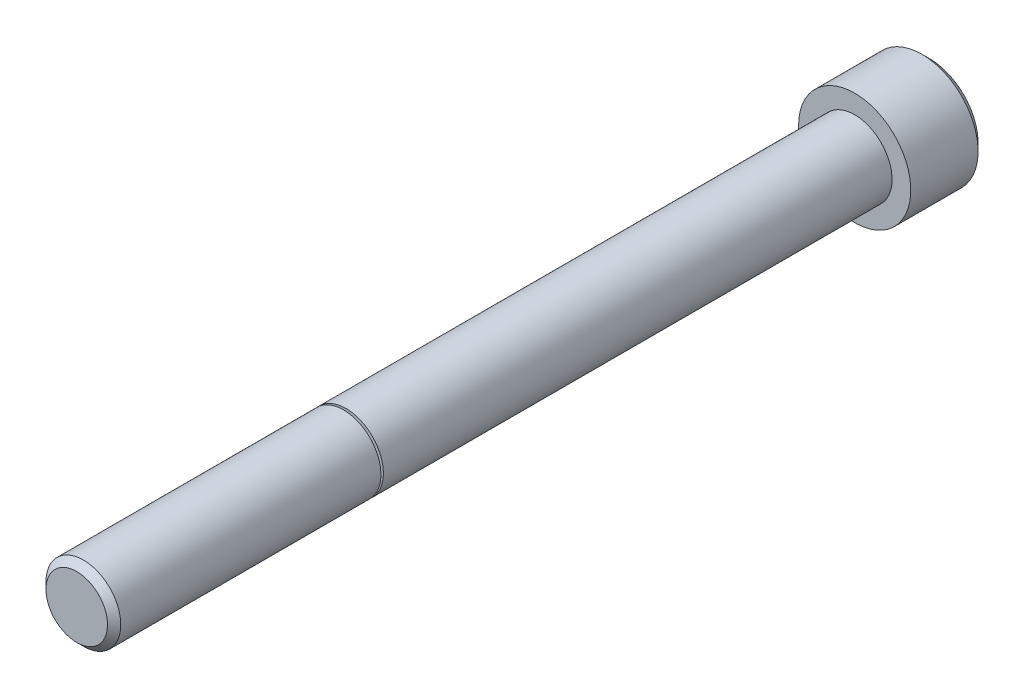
from build123d import *

# Parameters (mm, degrees)
CUT_EXTRUDE1_DEPTH = 3.96875


with BuildPart() as part:
    # Logo3_bib1 → Revolve1 (revolve)
    with BuildSketch(Plane(origin=(0, 0, 0), x_dir=(-1, 0, 0), z_dir=(0, -1, 0))):
        with BuildLine():
            Line((0, -82.55), (0, 7.9375))
            Line((0, 7.9375), (5.159375, 7.9375))
            Line((5.159375, 7.9375), (5.953125, 7.14375))
            Line((5.953125, 7.14375), (5.953125, 0))
            Line((5.953125, 0), (3.96875, 0))
            Line((3.96875, 0), (3.96875, -53.985))
            Line((3.96875, -53.985), (3.377325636, -53.985))
            ThreePointArc((3.377325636, -53.985), (3.357629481, -54.001527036), (3.370485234, -54.023793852))
            Line((3.370485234, -54.023793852), (3.96875, -54.24154442))
            Line((3.96875, -54.24154442), (3.96875, -81.84515))
            Line((3.96875, -81.84515), (3.2639, -82.55))
            Line((3.2639, -82.55), (0, -82.55))
        make_face()
    revolve(axis=Axis((0, 0, -10.585154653), (0, 0, 1)))

    # Logo3_bib2 → Cut-Extrude1 (cut)
    with BuildSketch(Plane(origin=(0, 0, -7.9375), x_dir=(1, 0, 0), z_dir=(0, 0, -1))):
        Polygon((3.666174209, 0), (1.833087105, 3.175), (-1.833087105, 3.175), (-3.666174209, 0), (-1.833087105, -3.175), (1.833087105, -3.175), align=None)
    extrude(amount=-CUT_EXTRUDE1_DEPTH, mode=Mode.SUBTRACT)


solid = part.part
